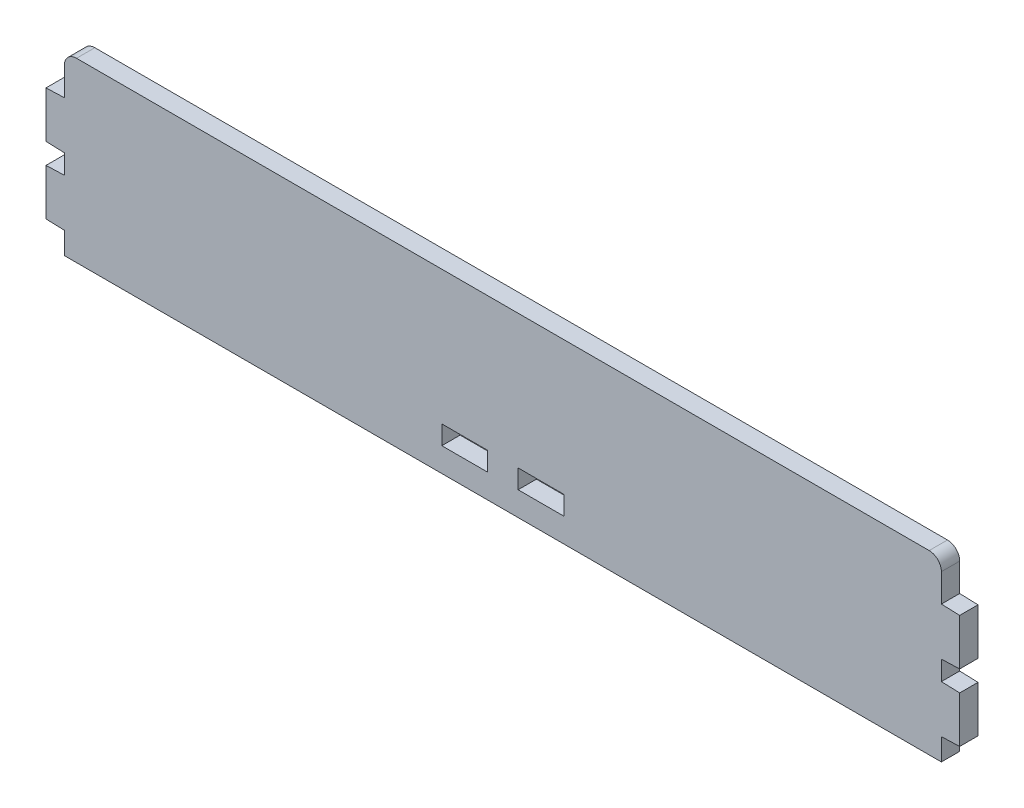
from build123d import *

# Parameters (mm, degrees)
SKETCH1_W           = 287.4
SKETCH1_H           = 58
BOSS_EXTRUDE1_DEPTH = 6
END_TABS_DEPTH      = 6
FILLET1_R           = 4
CUT_EXTRUDE1_REACH  = 168.278
SKETCH3_W           = 15
SKETCH3_H           = 6.2


with BuildPart() as part:
    # Sketch1 → Boss-Extrude1 (new body)
    with BuildSketch(Plane.XY):
        with Locations((2.8, 37)):
            Rectangle(SKETCH1_W, SKETCH1_H)
    extrude(amount=BOSS_EXTRUDE1_DEPTH)

    # Sketch2 → end tabs (add)
    with BuildSketch(Plane.XY.offset(6)):
        Polygon((-140.9, 15.190475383), (-140.9, 30.809524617), (-146.9, 30.6), (-146.9, 15.4), align=None)
        Polygon((-140.9, 37.190475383), (-140.9, 52.809524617), (-146.9, 52.6), (-146.9, 37.4), align=None)
        Polygon((146.5, 30.809524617), (146.5, 15.190475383), (152.5, 15.4), (152.5, 30.6), align=None)
        Polygon((146.5, 52.809524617), (146.5, 37.190475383), (152.5, 37.4), (152.5, 52.6), align=None)
    extrude(amount=-END_TABS_DEPTH)

    # Fillet1
    fillet1_edges = [part.edges().sort_by_distance(p)[0] for p in [
        (-140.9, 66, 3),
        (146.5, 66, 3),
    ]]
    fillet(fillet1_edges, radius=FILLET1_R)

    # Sketch3 → Cut-Extrude1 (cut, up to next)
    with BuildSketch(Plane.XY.offset(6), mode=Mode.PRIVATE) as cut_extrude1_sk1:
        with Locations((-9.7, 19)):
            Rectangle(SKETCH3_W, SKETCH3_H)
    cut_extrude1_tool1 = extrude(cut_extrude1_sk1.sketch, amount=-CUT_EXTRUDE1_REACH, mode=Mode.PRIVATE) & part.part
    # Sketch3 → Cut-Extrude1 (cut, up to next)
    with BuildSketch(Plane.XY.offset(6), mode=Mode.PRIVATE) as cut_extrude1_sk2:
        with Locations((15.3, 19)):
            Rectangle(SKETCH3_W, SKETCH3_H)
    cut_extrude1_tool2 = extrude(cut_extrude1_sk2.sketch, amount=-CUT_EXTRUDE1_REACH, mode=Mode.PRIVATE) & part.part
    add(cut_extrude1_tool1.solids().sort_by_distance((-9.7, 19, 6))[0], mode=Mode.SUBTRACT)
    add(cut_extrude1_tool2.solids().sort_by_distance((15.3, 19, 6))[0], mode=Mode.SUBTRACT)


solid = part.part
